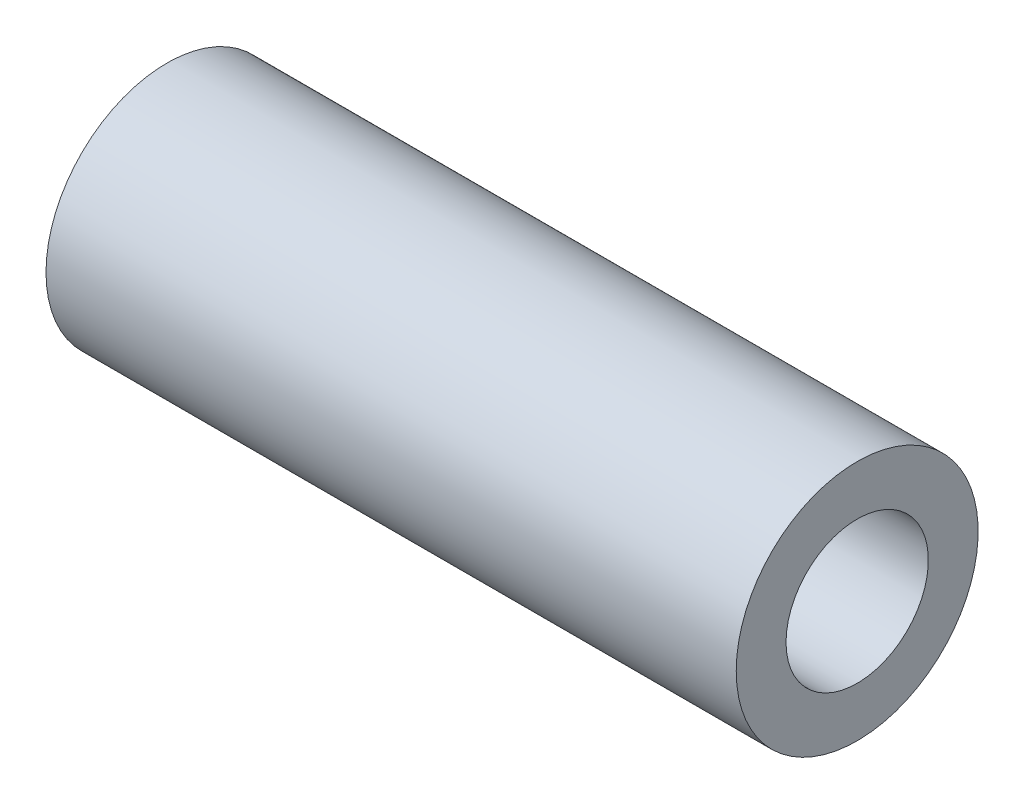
from build123d import *

# Parameters (mm, degrees)
SCHIZZO1_W = 48.5
SCHIZZO1_H = 3.5


with BuildPart() as part:
    # Schizzo1 → Rivoluzione1 (revolve)
    with BuildSketch(Plane.XY, mode=Mode.PRIVATE) as rivoluzione1_sk:
        with Locations((5.869823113, 6.75)):
            Rectangle(SCHIZZO1_W, SCHIZZO1_H)
    revolve(rivoluzione1_sk.sketch.rotate(Axis((-25.572018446, 0, 0), (1, 0, 0)), 90), axis=Axis((-25.572018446, 0, 0), (1, 0, 0)))


solid = part.part
